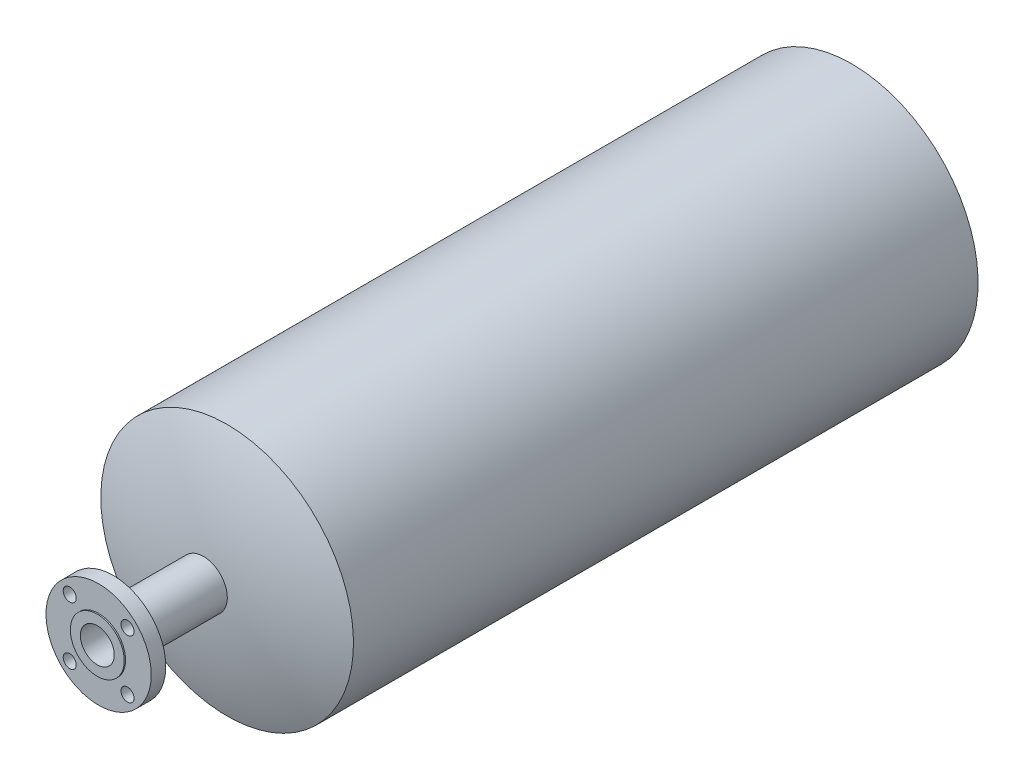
ISO-10303-21;
HEADER;
FILE_DESCRIPTION(('STEP AP214'),'2;1');
FILE_NAME('part.step','',(''),(''),'','','');
FILE_SCHEMA(('AUTOMOTIVE_DESIGN { 1 0 10303 214 1 1 1 1 }'));
ENDSEC;
DATA;
#1=APPLICATION_CONTEXT('core data for automotive mechanical design processes');
#2=APPLICATION_PROTOCOL_DEFINITION('international standard','automotive_design',2000,#1);
#3=PRODUCT_CONTEXT('',#1,'mechanical');
#4=PRODUCT('Part','Part','',(#3));
#5=PRODUCT_RELATED_PRODUCT_CATEGORY('part','',(#4));
#6=PRODUCT_DEFINITION_FORMATION('','',#4);
#7=PRODUCT_DEFINITION_CONTEXT('part definition',#1,'design');
#8=PRODUCT_DEFINITION('design','',#6,#7);
#9=PRODUCT_DEFINITION_SHAPE('','',#8);
#10=(LENGTH_UNIT() NAMED_UNIT(*) SI_UNIT(.MILLI.,.METRE.));
#11=(NAMED_UNIT(*) PLANE_ANGLE_UNIT() SI_UNIT($,.RADIAN.));
#12=(NAMED_UNIT(*) SI_UNIT($,.STERADIAN.) SOLID_ANGLE_UNIT());
#13=UNCERTAINTY_MEASURE_WITH_UNIT(LENGTH_MEASURE(1.E-05),#10,'distance_accuracy_value','');
#14=(GEOMETRIC_REPRESENTATION_CONTEXT(3) GLOBAL_UNCERTAINTY_ASSIGNED_CONTEXT((#13)) GLOBAL_UNIT_ASSIGNED_CONTEXT((#10,
#11,#12)) REPRESENTATION_CONTEXT('',''));
#15=CARTESIAN_POINT('',(0.,0.,0.));
#16=DIRECTION('',(0.,0.,1.));
#17=DIRECTION('',(1.,0.,0.));
#18=AXIS2_PLACEMENT_3D('',#15,#16,#17);
#19=CARTESIAN_POINT('',(0.,0.,-406.4));
#20=DIRECTION('',(0.,0.,-1.));
#21=DIRECTION('',(0.,1.,0.));
#22=AXIS2_PLACEMENT_3D('',#19,#20,#21);
#23=SPHERICAL_SURFACE('',#22,406.4);
#24=CARTESIAN_POINT('',(0.,0.,-29.6571168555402));
#25=DIRECTION('',(0.,0.,-1.));
#26=DIRECTION('',(-1.,0.,0.));
#27=AXIS2_PLACEMENT_3D('',#24,#25,#26);
#28=CIRCLE('',#27,152.4);
#29=CARTESIAN_POINT('',(0.,152.4,-29.6571168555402));
#30=VERTEX_POINT('',#29);
#31=EDGE_CURVE('E40',#30,#30,#28,.T.);
#32=CARTESIAN_POINT('',(0.,0.,-1.02381821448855));
#33=DIRECTION('',(0.,0.,-1.));
#34=DIRECTION('',(0.,1.,0.));
#35=AXIS2_PLACEMENT_3D('',#32,#33,#34);
#36=CIRCLE('',#35,28.829);
#37=CARTESIAN_POINT('',(0.,28.828999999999,-1.02381821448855));
#38=VERTEX_POINT('',#37);
#39=EDGE_CURVE('E47',#38,#38,#36,.T.);
#40=CARTESIAN_POINT('',(0.,152.4,-29.6571168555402));
#41=CARTESIAN_POINT('',(0.,151.17009293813,-29.1595947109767));
#42=CARTESIAN_POINT('',(0.,149.937749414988,-28.6680956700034));
#43=CARTESIAN_POINT('',(0.,147.468308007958,-27.6971900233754));
#44=CARTESIAN_POINT('',(0.,146.231210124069,-27.2177834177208));
#45=CARTESIAN_POINT('',(0.,143.752378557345,-26.2711088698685));
#46=CARTESIAN_POINT('',(0.,142.510644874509,-25.8038409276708));
#47=CARTESIAN_POINT('',(0.,140.022660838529,-24.8814884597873));
#48=CARTESIAN_POINT('',(0.,138.776410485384,-24.4264039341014));
#49=CARTESIAN_POINT('',(0.,136.279512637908,-23.5284619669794));
#50=CARTESIAN_POINT('',(0.,135.028865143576,-23.0856045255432));
#51=CARTESIAN_POINT('',(0.,132.523292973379,-22.2121591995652));
#52=CARTESIAN_POINT('',(0.,131.268368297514,-21.7815713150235));
#53=CARTESIAN_POINT('',(0.,128.754362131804,-20.9327064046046));
#54=CARTESIAN_POINT('',(0.,127.49528064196,-20.5144293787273));
#55=CARTESIAN_POINT('',(0.,124.973081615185,-19.6902263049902));
#56=CARTESIAN_POINT('',(0.,123.709964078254,-19.2843002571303));
#57=CARTESIAN_POINT('',(0.,121.179814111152,-18.4848380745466));
#58=CARTESIAN_POINT('',(0.,119.912781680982,-18.0913019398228));
#59=CARTESIAN_POINT('',(0.,117.374923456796,-17.3166573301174));
#60=CARTESIAN_POINT('',(0.,116.104097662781,-16.9355488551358));
#61=CARTESIAN_POINT('',(0.,113.558774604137,-16.1857961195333));
#62=CARTESIAN_POINT('',(0.,112.284277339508,-15.8171518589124));
#63=CARTESIAN_POINT('',(0.,109.731733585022,-15.092362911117));
#64=CARTESIAN_POINT('',(0.,108.453687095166,-14.7362182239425));
#65=CARTESIAN_POINT('',(0.,105.894167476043,-14.036462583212));
#66=CARTESIAN_POINT('',(0.,104.612694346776,-13.692851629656));
#67=CARTESIAN_POINT('',(0.,102.04644436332,-13.0181964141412));
#68=CARTESIAN_POINT('',(0.,100.761667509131,-12.6871521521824));
#69=CARTESIAN_POINT('',(0.,98.1889333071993,-12.0376620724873));
#70=CARTESIAN_POINT('',(0.,96.9009759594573,-11.7192162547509));
#71=CARTESIAN_POINT('',(0.,94.3220043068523,-11.0949536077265));
#72=CARTESIAN_POINT('',(0.,93.0309900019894,-10.7891367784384));
#73=CARTESIAN_POINT('',(0.,90.4460282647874,-10.1901614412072));
#74=CARTESIAN_POINT('',(0.,89.1520808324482,-9.89700293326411));
#75=CARTESIAN_POINT('',(0.,86.5613769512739,-9.32337235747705));
#76=CARTESIAN_POINT('',(0.,85.2646205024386,-9.04290028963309));
#77=CARTESIAN_POINT('',(0.,82.6684229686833,-8.49466949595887));
#78=CARTESIAN_POINT('',(0.,81.3689818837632,-8.22691077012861));
#79=CARTESIAN_POINT('',(0.,78.7675397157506,-7.70413234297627));
#80=CARTESIAN_POINT('',(0.,77.4655386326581,-7.4491126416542));
#81=CARTESIAN_POINT('',(0.,74.8591013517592,-6.95183672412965));
#82=CARTESIAN_POINT('',(0.,73.5546651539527,-6.70958050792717));
#83=CARTESIAN_POINT('',(0.,70.9434827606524,-6.23785479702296));
#84=CARTESIAN_POINT('',(0.,69.6367365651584,-6.00838530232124));
#85=CARTESIAN_POINT('',(0.,67.0210595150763,-5.56225504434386));
#86=CARTESIAN_POINT('',(0.,65.712128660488,-5.34559428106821));
#87=CARTESIAN_POINT('',(0.,63.0922078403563,-4.92510226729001));
#88=CARTESIAN_POINT('',(0.,61.7812178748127,-4.72127101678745));
#89=CARTESIAN_POINT('',(0.,59.1573045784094,-4.32645757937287));
#90=CARTESIAN_POINT('',(0.,57.8443812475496,-4.13547539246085));
#91=CARTESIAN_POINT('',(0.,55.2167271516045,-3.76637840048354));
#92=CARTESIAN_POINT('',(0.,53.9019963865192,-3.58826359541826));
#93=CARTESIAN_POINT('',(0.,51.2708535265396,-3.24491845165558));
#94=CARTESIAN_POINT('',(0.,49.9544414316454,-3.07968811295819));
#95=CARTESIAN_POINT('',(0.,47.3200621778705,-2.76212774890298));
#96=CARTESIAN_POINT('',(0.,46.0020950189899,-2.60979772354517));
#97=CARTESIAN_POINT('',(0.,43.3647320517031,-2.31805260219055));
#98=CARTESIAN_POINT('',(0.,42.0453362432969,-2.17863750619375));
#99=CARTESIAN_POINT('',(0.,39.4052425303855,-1.91273559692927));
#100=CARTESIAN_POINT('',(0.,38.0845446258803,-1.7862487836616));
#101=CARTESIAN_POINT('',(0.,35.4419733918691,-1.54621564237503));
#102=CARTESIAN_POINT('',(0.,34.120100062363,-1.43266931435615));
#103=CARTESIAN_POINT('',(0.,31.4753047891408,-1.21852777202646));
#104=CARTESIAN_POINT('',(0.,30.1523828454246,-1.11793255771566));
#105=CARTESIAN_POINT('',(0.,28.828999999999,-1.02381821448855));
#106=B_SPLINE_CURVE_WITH_KNOTS('',3,(#40,#41,#42,#43,#44,#45,#46,#47,#48,#49,#50,#51,#52,#53,
#54,#55,#56,#57,#58,#59,#60,#61,#62,#63,#64,#65,#66,#67,#68,#69,#70,#71,#72,#73,#74,#75,#76,#77,
#78,#79,#80,#81,#82,#83,#84,#85,#86,#87,#88,#89,#90,#91,#92,#93,#94,#95,#96,#97,#98,#99,#100,
#101,#102,#103,#104,#105),.UNSPECIFIED.,.F.,.F.,(4,2,2,2,2,2,2,2,2,2,2,2,2,2,2,2,2,2,2,2,2,2,2,
2,2,2,2,2,2,2,2,2,4),(0.,3.98015958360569,7.96031916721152,11.9404787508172,15.920638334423,
19.9007979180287,23.8809575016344,27.8611170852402,31.8412766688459,35.8214362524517,
39.8015958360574,43.7817554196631,47.7619150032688,51.7420745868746,55.7222341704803,
59.7023937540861,63.6825533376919,67.6627129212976,71.6428725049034,75.623032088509,
79.6031916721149,83.5833512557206,87.5635108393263,91.5436704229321,95.5238300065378,
99.5039895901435,103.484149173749,107.464308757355,111.444468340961,115.424627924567,
119.404787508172,123.384947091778,127.365106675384),.UNSPECIFIED.);
#107=EDGE_CURVE('BSEAM32',#30,#38,#106,.T.);
#108=ORIENTED_EDGE('',*,*,#31,.F.);
#109=ORIENTED_EDGE('',*,*,#39,.T.);
#110=ORIENTED_EDGE('',*,*,#107,.T.);
#111=ORIENTED_EDGE('',*,*,#107,.F.);
#112=EDGE_LOOP('',(#108,#110,#109,#111));
#113=FACE_BOUND('',#112,.T.);
#114=ADVANCED_FACE('F32',(#113),#23,.T.);
#115=CARTESIAN_POINT('',(0.,0.,-406.4));
#116=DIRECTION('',(0.,0.,-1.));
#117=DIRECTION('',(0.,1.,0.));
#118=AXIS2_PLACEMENT_3D('',#115,#116,#117);
#119=SPHERICAL_SURFACE('',#118,406.4);
#120=CARTESIAN_POINT('',(0.,0.,-783.14288314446));
#121=DIRECTION('',(0.,0.,-1.));
#122=DIRECTION('',(-1.,0.,0.));
#123=AXIS2_PLACEMENT_3D('',#120,#121,#122);
#124=CIRCLE('',#123,152.4);
#125=CARTESIAN_POINT('',(-152.4,0.,-783.14288314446));
#126=VERTEX_POINT('',#125);
#127=EDGE_CURVE('E10',#126,#126,#124,.T.);
#128=ORIENTED_EDGE('',*,*,#127,.T.);
#129=EDGE_LOOP('',(#128));
#130=FACE_BOUND('',#129,.T.);
#131=ADVANCED_FACE('F132',(#130),#119,.T.);
#132=CARTESIAN_POINT('',(0.,0.,-812.8));
#133=DIRECTION('',(0.,0.,-1.));
#134=DIRECTION('',(-1.,0.,0.));
#135=AXIS2_PLACEMENT_3D('',#132,#133,#134);
#136=CYLINDRICAL_SURFACE('',#135,152.4);
#137=ORIENTED_EDGE('',*,*,#31,.T.);
#138=EDGE_LOOP('',(#137));
#139=FACE_BOUND('',#138,.T.);
#140=ORIENTED_EDGE('',*,*,#127,.F.);
#141=EDGE_LOOP('',(#140));
#142=FACE_BOUND('',#141,.T.);
#143=ADVANCED_FACE('F128',(#139,#142),#136,.T.);
#144=CARTESIAN_POINT('',(0.,0.,-25.4));
#145=DIRECTION('',(0.,0.,-1.));
#146=DIRECTION('',(0.,1.,0.));
#147=AXIS2_PLACEMENT_3D('',#144,#145,#146);
#148=CYLINDRICAL_SURFACE('',#147,20.447);
#149=CARTESIAN_POINT('',(0.,0.,-0.514695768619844));
#150=DIRECTION('',(0.,0.,-1.));
#151=DIRECTION('',(0.,1.,0.));
#152=AXIS2_PLACEMENT_3D('',#149,#150,#151);
#153=CIRCLE('',#152,20.447);
#154=CARTESIAN_POINT('',(0.,20.4470000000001,-0.514695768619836));
#155=VERTEX_POINT('',#154);
#156=EDGE_CURVE('E36',#155,#155,#153,.F.);
#157=ORIENTED_EDGE('',*,*,#156,.F.);
#158=EDGE_LOOP('',(#157));
#159=FACE_BOUND('',#158,.T.);
#160=CARTESIAN_POINT('',(0.,0.,127.));
#161=DIRECTION('',(0.,0.,-1.));
#162=DIRECTION('',(0.,1.,0.));
#163=AXIS2_PLACEMENT_3D('',#160,#161,#162);
#164=CIRCLE('',#163,20.447);
#165=CARTESIAN_POINT('',(0.,20.447,127.));
#166=VERTEX_POINT('',#165);
#167=EDGE_CURVE('E49',#166,#166,#164,.T.);
#168=ORIENTED_EDGE('',*,*,#167,.F.);
#169=EDGE_LOOP('',(#168));
#170=FACE_BOUND('',#169,.T.);
#171=ADVANCED_FACE('F123',(#159,#170),#148,.F.);
#172=CARTESIAN_POINT('',(0.,-20.447,127.));
#173=DIRECTION('',(0.,0.,-1.));
#174=DIRECTION('',(0.,1.,0.));
#175=AXIS2_PLACEMENT_3D('',#172,#173,#174);
#176=PLANE('',#175);
#177=CARTESIAN_POINT('',(0.,0.,127.));
#178=DIRECTION('',(0.,0.,-1.));
#179=DIRECTION('',(0.,1.,0.));
#180=AXIS2_PLACEMENT_3D('',#177,#178,#179);
#181=CIRCLE('',#180,32.512);
#182=CARTESIAN_POINT('',(0.,32.512,127.));
#183=VERTEX_POINT('',#182);
#184=EDGE_CURVE('E54',#183,#183,#181,.T.);
#185=ORIENTED_EDGE('',*,*,#184,.F.);
#186=EDGE_LOOP('',(#185));
#187=FACE_BOUND('',#186,.T.);
#188=ORIENTED_EDGE('',*,*,#167,.T.);
#189=EDGE_LOOP('',(#188));
#190=FACE_BOUND('',#189,.T.);
#191=ADVANCED_FACE('F118',(#187,#190),#176,.F.);
#192=CARTESIAN_POINT('',(0.,0.,-25.4));
#193=DIRECTION('',(0.,0.,-1.));
#194=DIRECTION('',(0.,1.,0.));
#195=AXIS2_PLACEMENT_3D('',#192,#193,#194);
#196=CYLINDRICAL_SURFACE('',#195,32.512);
#197=CARTESIAN_POINT('',(0.,0.,125.4125));
#198=DIRECTION('',(0.,0.,-1.));
#199=DIRECTION('',(0.,1.,0.));
#200=AXIS2_PLACEMENT_3D('',#197,#198,#199);
#201=CIRCLE('',#200,32.512);
#202=CARTESIAN_POINT('',(0.,32.512,125.4125));
#203=VERTEX_POINT('',#202);
#204=EDGE_CURVE('E58',#203,#203,#201,.T.);
#205=ORIENTED_EDGE('',*,*,#204,.F.);
#206=EDGE_LOOP('',(#205));
#207=FACE_BOUND('',#206,.T.);
#208=ORIENTED_EDGE('',*,*,#184,.T.);
#209=EDGE_LOOP('',(#208));
#210=FACE_BOUND('',#209,.T.);
#211=ADVANCED_FACE('F104',(#207,#210),#196,.T.);
#212=CARTESIAN_POINT('',(0.,-32.512,125.4125));
#213=DIRECTION('',(0.,0.,-1.));
#214=DIRECTION('',(0.,1.,0.));
#215=AXIS2_PLACEMENT_3D('',#212,#213,#214);
#216=PLANE('',#215);
#217=CARTESIAN_POINT('',(34.8433937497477,-34.8433937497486,125.4125));
#218=DIRECTION('',(0.,0.,1.));
#219=DIRECTION('',(0.,1.,0.));
#220=AXIS2_PLACEMENT_3D('',#217,#218,#219);
#221=CIRCLE('',#220,7.87400000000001);
#222=CARTESIAN_POINT('',(34.8433937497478,-26.9693937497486,125.4125));
#223=VERTEX_POINT('',#222);
#224=EDGE_CURVE('E93',#223,#223,#221,.T.);
#225=ORIENTED_EDGE('',*,*,#224,.F.);
#226=EDGE_LOOP('',(#225));
#227=FACE_BOUND('',#226,.T.);
#228=CARTESIAN_POINT('',(34.8433937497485,34.8433937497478,125.4125));
#229=DIRECTION('',(0.,0.,1.));
#230=DIRECTION('',(-1.,0.,0.));
#231=AXIS2_PLACEMENT_3D('',#228,#229,#230);
#232=CIRCLE('',#231,7.87400000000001);
#233=CARTESIAN_POINT('',(26.9693937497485,34.8433937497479,125.4125));
#234=VERTEX_POINT('',#233);
#235=EDGE_CURVE('E87',#234,#234,#232,.T.);
#236=ORIENTED_EDGE('',*,*,#235,.F.);
#237=EDGE_LOOP('',(#236));
#238=FACE_BOUND('',#237,.T.);
#239=CARTESIAN_POINT('',(-34.843393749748,34.8433937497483,125.4125));
#240=DIRECTION('',(0.,0.,1.));
#241=DIRECTION('',(0.,-1.,0.));
#242=AXIS2_PLACEMENT_3D('',#239,#240,#241);
#243=CIRCLE('',#242,7.87400000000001);
#244=CARTESIAN_POINT('',(-34.843393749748,26.9693937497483,125.4125));
#245=VERTEX_POINT('',#244);
#246=EDGE_CURVE('E81',#245,#245,#243,.T.);
#247=ORIENTED_EDGE('',*,*,#246,.F.);
#248=EDGE_LOOP('',(#247));
#249=FACE_BOUND('',#248,.T.);
#250=CARTESIAN_POINT('',(-34.8433937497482,-34.8433937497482,125.4125));
#251=DIRECTION('',(0.,0.,1.));
#252=DIRECTION('',(1.,0.,0.));
#253=AXIS2_PLACEMENT_3D('',#250,#251,#252);
#254=CIRCLE('',#253,7.87400000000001);
#255=CARTESIAN_POINT('',(-26.9693937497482,-34.8433937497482,125.4125));
#256=VERTEX_POINT('',#255);
#257=EDGE_CURVE('E75',#256,#256,#254,.T.);
#258=ORIENTED_EDGE('',*,*,#257,.F.);
#259=EDGE_LOOP('',(#258));
#260=FACE_BOUND('',#259,.T.);
#261=CARTESIAN_POINT('',(0.,0.,125.4125));
#262=DIRECTION('',(0.,0.,-1.));
#263=DIRECTION('',(0.,1.,0.));
#264=AXIS2_PLACEMENT_3D('',#261,#262,#263);
#265=CIRCLE('',#264,63.5);
#266=CARTESIAN_POINT('',(0.,63.5,125.4125));
#267=VERTEX_POINT('',#266);
#268=EDGE_CURVE('E63',#267,#267,#265,.T.);
#269=ORIENTED_EDGE('',*,*,#268,.F.);
#270=EDGE_LOOP('',(#269));
#271=FACE_BOUND('',#270,.T.);
#272=ORIENTED_EDGE('',*,*,#204,.T.);
#273=EDGE_LOOP('',(#272));
#274=FACE_BOUND('',#273,.T.);
#275=ADVANCED_FACE('F100',(#227,#238,#249,#260,#271,#274),#216,.F.);
#276=CARTESIAN_POINT('',(0.,0.,-25.4));
#277=DIRECTION('',(0.,0.,-1.));
#278=DIRECTION('',(0.,1.,0.));
#279=AXIS2_PLACEMENT_3D('',#276,#277,#278);
#280=CYLINDRICAL_SURFACE('',#279,63.5);
#281=CARTESIAN_POINT('',(0.,0.,107.8865));
#282=DIRECTION('',(0.,0.,-1.));
#283=DIRECTION('',(0.,1.,0.));
#284=AXIS2_PLACEMENT_3D('',#281,#282,#283);
#285=CIRCLE('',#284,63.5);
#286=CARTESIAN_POINT('',(0.,63.5,107.8865));
#287=VERTEX_POINT('',#286);
#288=EDGE_CURVE('E66',#287,#287,#285,.T.);
#289=ORIENTED_EDGE('',*,*,#288,.F.);
#290=EDGE_LOOP('',(#289));
#291=FACE_BOUND('',#290,.T.);
#292=ORIENTED_EDGE('',*,*,#268,.T.);
#293=EDGE_LOOP('',(#292));
#294=FACE_BOUND('',#293,.T.);
#295=ADVANCED_FACE('F103',(#291,#294),#280,.T.);
#296=CARTESIAN_POINT('',(0.,-63.5,107.8865));
#297=DIRECTION('',(0.,0.,1.));
#298=DIRECTION('',(0.,-1.,0.));
#299=AXIS2_PLACEMENT_3D('',#296,#297,#298);
#300=PLANE('',#299);
#301=CARTESIAN_POINT('',(34.8433937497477,-34.8433937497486,107.8865));
#302=DIRECTION('',(0.,0.,1.));
#303=DIRECTION('',(0.,-1.,0.));
#304=AXIS2_PLACEMENT_3D('',#301,#302,#303);
#305=CIRCLE('',#304,7.87400000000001);
#306=CARTESIAN_POINT('',(34.8433937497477,-42.7173937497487,107.8865));
#307=VERTEX_POINT('',#306);
#308=EDGE_CURVE('E90',#307,#307,#305,.F.);
#309=ORIENTED_EDGE('',*,*,#308,.F.);
#310=EDGE_LOOP('',(#309));
#311=FACE_BOUND('',#310,.T.);
#312=CARTESIAN_POINT('',(34.8433937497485,34.8433937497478,107.8865));
#313=DIRECTION('',(0.,0.,1.));
#314=DIRECTION('',(0.,-1.,0.));
#315=AXIS2_PLACEMENT_3D('',#312,#313,#314);
#316=CIRCLE('',#315,7.87400000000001);
#317=CARTESIAN_POINT('',(34.8433937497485,26.9693937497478,107.8865));
#318=VERTEX_POINT('',#317);
#319=EDGE_CURVE('E84',#318,#318,#316,.F.);
#320=ORIENTED_EDGE('',*,*,#319,.F.);
#321=EDGE_LOOP('',(#320));
#322=FACE_BOUND('',#321,.T.);
#323=CARTESIAN_POINT('',(-34.843393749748,34.8433937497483,107.8865));
#324=DIRECTION('',(0.,0.,1.));
#325=DIRECTION('',(0.,-1.,0.));
#326=AXIS2_PLACEMENT_3D('',#323,#324,#325);
#327=CIRCLE('',#326,7.87400000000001);
#328=CARTESIAN_POINT('',(-34.843393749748,26.9693937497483,107.8865));
#329=VERTEX_POINT('',#328);
#330=EDGE_CURVE('E78',#329,#329,#327,.F.);
#331=ORIENTED_EDGE('',*,*,#330,.F.);
#332=EDGE_LOOP('',(#331));
#333=FACE_BOUND('',#332,.T.);
#334=CARTESIAN_POINT('',(-34.8433937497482,-34.8433937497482,107.8865));
#335=DIRECTION('',(0.,0.,1.));
#336=DIRECTION('',(0.,-1.,0.));
#337=AXIS2_PLACEMENT_3D('',#334,#335,#336);
#338=CIRCLE('',#337,7.87400000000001);
#339=CARTESIAN_POINT('',(-34.8433937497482,-42.7173937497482,107.8865));
#340=VERTEX_POINT('',#339);
#341=EDGE_CURVE('E72',#340,#340,#338,.F.);
#342=ORIENTED_EDGE('',*,*,#341,.F.);
#343=EDGE_LOOP('',(#342));
#344=FACE_BOUND('',#343,.T.);
#345=CARTESIAN_POINT('',(0.,0.,107.8865));
#346=DIRECTION('',(0.,0.,-1.));
#347=DIRECTION('',(0.,1.,0.));
#348=AXIS2_PLACEMENT_3D('',#345,#346,#347);
#349=CIRCLE('',#348,28.829);
#350=CARTESIAN_POINT('',(0.,28.829,107.8865));
#351=VERTEX_POINT('',#350);
#352=EDGE_CURVE('E69',#351,#351,#349,.T.);
#353=ORIENTED_EDGE('',*,*,#352,.F.);
#354=EDGE_LOOP('',(#353));
#355=FACE_BOUND('',#354,.T.);
#356=ORIENTED_EDGE('',*,*,#288,.T.);
#357=EDGE_LOOP('',(#356));
#358=FACE_BOUND('',#357,.T.);
#359=ADVANCED_FACE('F149',(#311,#322,#333,#344,#355,#358),#300,.F.);
#360=CARTESIAN_POINT('',(0.,0.,-25.4));
#361=DIRECTION('',(0.,0.,-1.));
#362=DIRECTION('',(0.,1.,0.));
#363=AXIS2_PLACEMENT_3D('',#360,#361,#362);
#364=CYLINDRICAL_SURFACE('',#363,28.829);
#365=ORIENTED_EDGE('',*,*,#39,.F.);
#366=EDGE_LOOP('',(#365));
#367=FACE_BOUND('',#366,.T.);
#368=ORIENTED_EDGE('',*,*,#352,.T.);
#369=EDGE_LOOP('',(#368));
#370=FACE_BOUND('',#369,.T.);
#371=ADVANCED_FACE('F140',(#367,#370),#364,.T.);
#372=ORIENTED_EDGE('',*,*,#156,.T.);
#373=EDGE_LOOP('',(#372));
#374=FACE_BOUND('',#373,.T.);
#375=ADVANCED_FACE('F34',(#374),#23,.T.);
#376=CARTESIAN_POINT('',(-34.8433937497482,-34.8433937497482,-812.801));
#377=DIRECTION('',(0.,0.,1.));
#378=DIRECTION('',(1.,0.,0.));
#379=AXIS2_PLACEMENT_3D('',#376,#377,#378);
#380=CYLINDRICAL_SURFACE('',#379,7.87400000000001);
#381=ORIENTED_EDGE('',*,*,#257,.T.);
#382=EDGE_LOOP('',(#381));
#383=FACE_BOUND('',#382,.T.);
#384=ORIENTED_EDGE('',*,*,#341,.T.);
#385=EDGE_LOOP('',(#384));
#386=FACE_BOUND('',#385,.T.);
#387=ADVANCED_FACE('F139',(#383,#386),#380,.F.);
#388=CARTESIAN_POINT('',(-34.8433937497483,34.8433937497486,-812.801));
#389=DIRECTION('',(0.,0.,1.));
#390=DIRECTION('',(0.,-1.,0.));
#391=AXIS2_PLACEMENT_3D('',#388,#389,#390);
#392=CYLINDRICAL_SURFACE('',#391,7.87400000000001);
#393=ORIENTED_EDGE('',*,*,#246,.T.);
#394=EDGE_LOOP('',(#393));
#395=FACE_BOUND('',#394,.T.);
#396=ORIENTED_EDGE('',*,*,#330,.T.);
#397=EDGE_LOOP('',(#396));
#398=FACE_BOUND('',#397,.T.);
#399=ADVANCED_FACE('F146',(#395,#398),#392,.F.);
#400=CARTESIAN_POINT('',(34.8433937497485,34.8433937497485,-812.801));
#401=DIRECTION('',(0.,0.,1.));
#402=DIRECTION('',(0.,-1.,0.));
#403=AXIS2_PLACEMENT_3D('',#400,#401,#402);
#404=CYLINDRICAL_SURFACE('',#403,7.87400000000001);
#405=ORIENTED_EDGE('',*,*,#235,.T.);
#406=EDGE_LOOP('',(#405));
#407=FACE_BOUND('',#406,.T.);
#408=ORIENTED_EDGE('',*,*,#319,.T.);
#409=EDGE_LOOP('',(#408));
#410=FACE_BOUND('',#409,.T.);
#411=ADVANCED_FACE('F193',(#407,#410),#404,.F.);
#412=CARTESIAN_POINT('',(34.8433937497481,-34.8433937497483,-812.801));
#413=DIRECTION('',(0.,0.,1.));
#414=DIRECTION('',(1.,0.,0.));
#415=AXIS2_PLACEMENT_3D('',#412,#413,#414);
#416=CYLINDRICAL_SURFACE('',#415,7.87400000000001);
#417=ORIENTED_EDGE('',*,*,#224,.T.);
#418=EDGE_LOOP('',(#417));
#419=FACE_BOUND('',#418,.T.);
#420=ORIENTED_EDGE('',*,*,#308,.T.);
#421=EDGE_LOOP('',(#420));
#422=FACE_BOUND('',#421,.T.);
#423=ADVANCED_FACE('F97',(#419,#422),#416,.F.);
#424=CLOSED_SHELL('',(#114,#131,#143,#171,#191,#211,#275,#295,#359,#371,#375,#387,#399,#411,#423));
#425=MANIFOLD_SOLID_BREP('B2',#424);
#426=ADVANCED_BREP_SHAPE_REPRESENTATION('',(#18,#425),#14);
#427=SHAPE_DEFINITION_REPRESENTATION(#9,#426);
ENDSEC;
END-ISO-10303-21;
